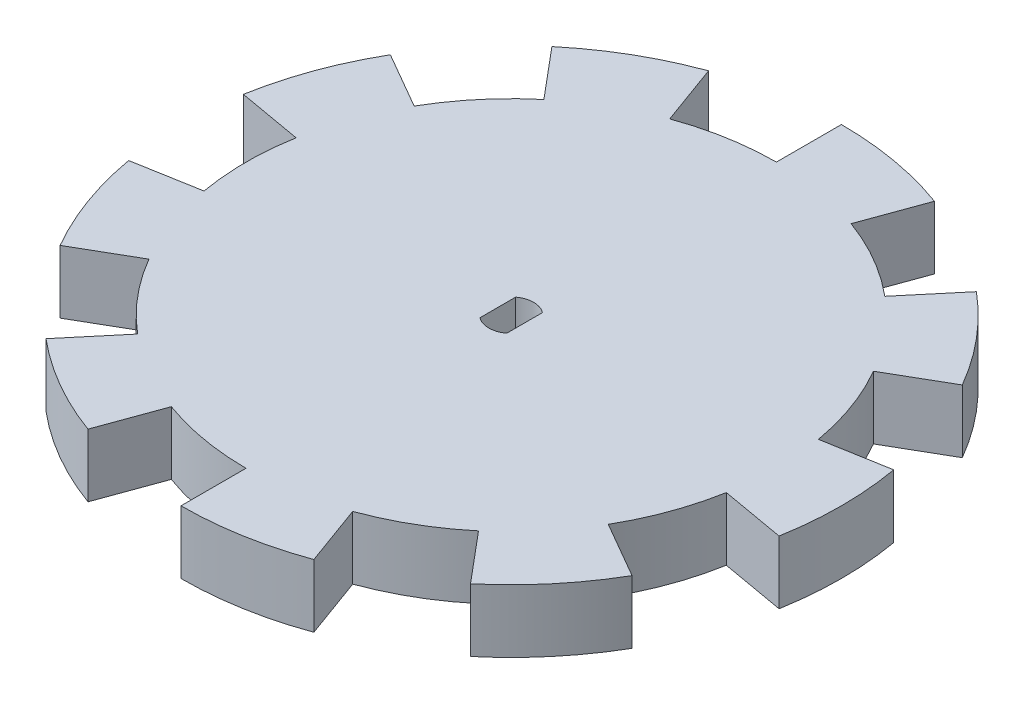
ISO-10303-21;
HEADER;
FILE_DESCRIPTION(('STEP AP214'),'2;1');
FILE_NAME('part.step','',(''),(''),'','','');
FILE_SCHEMA(('AUTOMOTIVE_DESIGN { 1 0 10303 214 1 1 1 1 }'));
ENDSEC;
DATA;
#1=APPLICATION_CONTEXT('core data for automotive mechanical design processes');
#2=APPLICATION_PROTOCOL_DEFINITION('international standard','automotive_design',2000,#1);
#3=PRODUCT_CONTEXT('',#1,'mechanical');
#4=PRODUCT('Part','Part','',(#3));
#5=PRODUCT_RELATED_PRODUCT_CATEGORY('part','',(#4));
#6=PRODUCT_DEFINITION_FORMATION('','',#4);
#7=PRODUCT_DEFINITION_CONTEXT('part definition',#1,'design');
#8=PRODUCT_DEFINITION('design','',#6,#7);
#9=PRODUCT_DEFINITION_SHAPE('','',#8);
#10=(LENGTH_UNIT() NAMED_UNIT(*) SI_UNIT(.MILLI.,.METRE.));
#11=(NAMED_UNIT(*) PLANE_ANGLE_UNIT() SI_UNIT($,.RADIAN.));
#12=(NAMED_UNIT(*) SI_UNIT($,.STERADIAN.) SOLID_ANGLE_UNIT());
#13=UNCERTAINTY_MEASURE_WITH_UNIT(LENGTH_MEASURE(1.E-05),#10,'distance_accuracy_value','');
#14=(GEOMETRIC_REPRESENTATION_CONTEXT(3) GLOBAL_UNCERTAINTY_ASSIGNED_CONTEXT((#13)) GLOBAL_UNIT_ASSIGNED_CONTEXT((#10,
#11,#12)) REPRESENTATION_CONTEXT('',''));
#15=CARTESIAN_POINT('',(0.,0.,0.));
#16=DIRECTION('',(0.,0.,1.));
#17=DIRECTION('',(1.,0.,0.));
#18=AXIS2_PLACEMENT_3D('',#15,#16,#17);
#19=CARTESIAN_POINT('',(0.,1.27,0.));
#20=DIRECTION('',(0.,-1.,0.));
#21=DIRECTION('',(0.,0.,-1.));
#22=AXIS2_PLACEMENT_3D('',#19,#20,#21);
#23=CYLINDRICAL_SURFACE('',#22,41.275);
#24=DIRECTION('',(0.,-1.,0.));
#25=VECTOR('',#24,1.);
#26=CARTESIAN_POINT('',(-35.7451985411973,29.8528857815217,-20.6375000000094));
#27=LINE('',#26,#25);
#28=CARTESIAN_POINT('',(-35.7451985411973,7.874,-20.6375000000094));
#29=VERTEX_POINT('',#28);
#30=CARTESIAN_POINT('',(-35.7451985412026,0.,-20.6375000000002));
#31=VERTEX_POINT('',#30);
#32=EDGE_CURVE('E407',#29,#31,#27,.T.);
#33=ORIENTED_EDGE('',*,*,#32,.T.);
#34=CARTESIAN_POINT('',(0.,0.,0.));
#35=DIRECTION('',(0.,1.,0.));
#36=DIRECTION('',(0.,0.,1.));
#37=AXIS2_PLACEMENT_3D('',#34,#35,#36);
#38=CIRCLE('',#37,41.275);
#39=CARTESIAN_POINT('',(-40.6479400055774,0.,-7.16732853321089));
#40=VERTEX_POINT('',#39);
#41=EDGE_CURVE('E402',#31,#40,#38,.T.);
#42=ORIENTED_EDGE('',*,*,#41,.T.);
#43=DIRECTION('',(0.,-1.,0.));
#44=VECTOR('',#43,1.);
#45=CARTESIAN_POINT('',(-40.6479400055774,29.8528857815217,-7.16732853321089));
#46=LINE('',#45,#44);
#47=CARTESIAN_POINT('',(-40.6479400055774,7.874,-7.16732853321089));
#48=VERTEX_POINT('',#47);
#49=EDGE_CURVE('E434',#48,#40,#46,.T.);
#50=ORIENTED_EDGE('',*,*,#49,.F.);
#51=CARTESIAN_POINT('',(0.,7.874,0.));
#52=DIRECTION('',(0.,1.,0.));
#53=DIRECTION('',(0.,0.,1.));
#54=AXIS2_PLACEMENT_3D('',#51,#52,#53);
#55=CIRCLE('',#54,41.275);
#56=EDGE_CURVE('E438',#48,#29,#55,.F.);
#57=ORIENTED_EDGE('',*,*,#56,.T.);
#58=EDGE_LOOP('',(#33,#42,#50,#57));
#59=FACE_BOUND('',#58,.T.);
#60=ADVANCED_FACE('F37',(#59),#23,.T.);
#61=CARTESIAN_POINT('',(-14.1168814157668,0.,-38.7858129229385));
#62=VERTEX_POINT('',#61);
#63=CARTESIAN_POINT('',(-26.5310585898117,0.,-31.618484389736));
#64=VERTEX_POINT('',#63);
#65=EDGE_CURVE('E637',#62,#64,#38,.T.);
#66=ORIENTED_EDGE('',*,*,#65,.T.);
#67=DIRECTION('',(0.,-1.,0.));
#68=VECTOR('',#67,1.);
#69=CARTESIAN_POINT('',(-26.5310585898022,29.8528857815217,-31.618484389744));
#70=LINE('',#69,#68);
#71=CARTESIAN_POINT('',(-26.5310585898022,7.874,-31.618484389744));
#72=VERTEX_POINT('',#71);
#73=EDGE_CURVE('E446',#72,#64,#70,.T.);
#74=ORIENTED_EDGE('',*,*,#73,.F.);
#75=CARTESIAN_POINT('',(0.,7.874,0.));
#76=DIRECTION('',(0.,1.,0.));
#77=DIRECTION('',(0.,0.,1.));
#78=AXIS2_PLACEMENT_3D('',#75,#76,#77);
#79=CIRCLE('',#78,41.275);
#80=CARTESIAN_POINT('',(-14.1168814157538,7.874,-38.7858129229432));
#81=VERTEX_POINT('',#80);
#82=EDGE_CURVE('E449',#72,#81,#79,.F.);
#83=ORIENTED_EDGE('',*,*,#82,.T.);
#84=DIRECTION('',(0.,-1.,0.));
#85=VECTOR('',#84,1.);
#86=CARTESIAN_POINT('',(-14.1168814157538,29.8528857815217,-38.7858129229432));
#87=LINE('',#86,#85);
#88=EDGE_CURVE('E452',#81,#62,#87,.T.);
#89=ORIENTED_EDGE('',*,*,#88,.T.);
#90=EDGE_LOOP('',(#66,#74,#83,#89));
#91=FACE_BOUND('',#90,.T.);
#92=ADVANCED_FACE('F781',(#91),#23,.T.);
#93=CARTESIAN_POINT('',(14.1168814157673,0.,-38.7858129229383));
#94=VERTEX_POINT('',#93);
#95=CARTESIAN_POINT('',(2.88221784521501E-13,0.,-41.275));
#96=VERTEX_POINT('',#95);
#97=EDGE_CURVE('E640',#94,#96,#38,.T.);
#98=ORIENTED_EDGE('',*,*,#97,.T.);
#99=DIRECTION('',(0.,-1.,0.));
#100=VECTOR('',#99,1.);
#101=CARTESIAN_POINT('',(1.4431689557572E-11,29.8528857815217,-41.275));
#102=LINE('',#101,#100);
#103=CARTESIAN_POINT('',(1.4431689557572E-11,7.874,-41.275));
#104=VERTEX_POINT('',#103);
#105=EDGE_CURVE('E458',#104,#96,#102,.T.);
#106=ORIENTED_EDGE('',*,*,#105,.F.);
#107=CARTESIAN_POINT('',(0.,7.874,0.));
#108=DIRECTION('',(0.,1.,0.));
#109=DIRECTION('',(0.,0.,1.));
#110=AXIS2_PLACEMENT_3D('',#107,#108,#109);
#111=CIRCLE('',#110,41.275);
#112=CARTESIAN_POINT('',(14.1168814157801,7.874,-38.7858129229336));
#113=VERTEX_POINT('',#112);
#114=EDGE_CURVE('E460',#104,#113,#111,.F.);
#115=ORIENTED_EDGE('',*,*,#114,.T.);
#116=DIRECTION('',(0.,-1.,0.));
#117=VECTOR('',#116,1.);
#118=CARTESIAN_POINT('',(14.1168814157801,29.8528857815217,-38.7858129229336));
#119=LINE('',#118,#117);
#120=EDGE_CURVE('E463',#113,#94,#119,.T.);
#121=ORIENTED_EDGE('',*,*,#120,.T.);
#122=EDGE_LOOP('',(#98,#106,#115,#121));
#123=FACE_BOUND('',#122,.T.);
#124=ADVANCED_FACE('F786',(#123),#23,.T.);
#125=CARTESIAN_POINT('',(35.7451985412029,0.,-20.6374999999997));
#126=VERTEX_POINT('',#125);
#127=CARTESIAN_POINT('',(26.5310585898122,0.,-31.6184843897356));
#128=VERTEX_POINT('',#127);
#129=EDGE_CURVE('E642',#126,#128,#38,.T.);
#130=ORIENTED_EDGE('',*,*,#129,.T.);
#131=DIRECTION('',(0.,-1.,0.));
#132=VECTOR('',#131,1.);
#133=CARTESIAN_POINT('',(26.5310585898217,29.8528857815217,-31.6184843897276));
#134=LINE('',#133,#132);
#135=CARTESIAN_POINT('',(26.5310585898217,7.874,-31.6184843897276));
#136=VERTEX_POINT('',#135);
#137=EDGE_CURVE('E469',#136,#128,#134,.T.);
#138=ORIENTED_EDGE('',*,*,#137,.F.);
#139=CARTESIAN_POINT('',(0.,7.874,0.));
#140=DIRECTION('',(0.,1.,0.));
#141=DIRECTION('',(0.,0.,1.));
#142=AXIS2_PLACEMENT_3D('',#139,#140,#141);
#143=CIRCLE('',#142,41.275);
#144=CARTESIAN_POINT('',(35.7451985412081,7.874,-20.6374999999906));
#145=VERTEX_POINT('',#144);
#146=EDGE_CURVE('E471',#136,#145,#143,.F.);
#147=ORIENTED_EDGE('',*,*,#146,.T.);
#148=DIRECTION('',(0.,-1.,0.));
#149=VECTOR('',#148,1.);
#150=CARTESIAN_POINT('',(35.7451985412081,29.8528857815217,-20.6374999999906));
#151=LINE('',#150,#149);
#152=EDGE_CURVE('E474',#145,#126,#151,.T.);
#153=ORIENTED_EDGE('',*,*,#152,.T.);
#154=EDGE_LOOP('',(#130,#138,#147,#153));
#155=FACE_BOUND('',#154,.T.);
#156=ADVANCED_FACE('F701',(#155),#23,.T.);
#157=CARTESIAN_POINT('',(40.6479400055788,0.,7.16732853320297));
#158=VERTEX_POINT('',#157);
#159=CARTESIAN_POINT('',(40.647940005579,0.,-7.16732853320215));
#160=VERTEX_POINT('',#159);
#161=EDGE_CURVE('E689',#158,#160,#38,.T.);
#162=ORIENTED_EDGE('',*,*,#161,.T.);
#163=DIRECTION('',(0.,-1.,0.));
#164=VECTOR('',#163,1.);
#165=CARTESIAN_POINT('',(40.6479400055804,29.8528857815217,-7.16732853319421));
#166=LINE('',#165,#164);
#167=CARTESIAN_POINT('',(40.6479400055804,7.874,-7.16732853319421));
#168=VERTEX_POINT('',#167);
#169=EDGE_CURVE('E480',#168,#160,#166,.T.);
#170=ORIENTED_EDGE('',*,*,#169,.F.);
#171=CARTESIAN_POINT('',(0.,7.874,0.));
#172=DIRECTION('',(0.,1.,0.));
#173=DIRECTION('',(0.,0.,1.));
#174=AXIS2_PLACEMENT_3D('',#171,#172,#173);
#175=CIRCLE('',#174,41.275);
#176=CARTESIAN_POINT('',(40.6479400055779,7.874,7.16732853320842));
#177=VERTEX_POINT('',#176);
#178=EDGE_CURVE('E482',#168,#177,#175,.F.);
#179=ORIENTED_EDGE('',*,*,#178,.T.);
#180=DIRECTION('',(0.,-1.,0.));
#181=VECTOR('',#180,1.);
#182=CARTESIAN_POINT('',(40.6479400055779,29.8528857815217,7.16732853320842));
#183=LINE('',#182,#181);
#184=EDGE_CURVE('E485',#177,#158,#183,.T.);
#185=ORIENTED_EDGE('',*,*,#184,.T.);
#186=EDGE_LOOP('',(#162,#170,#179,#185));
#187=FACE_BOUND('',#186,.T.);
#188=ADVANCED_FACE('F728',(#187),#23,.T.);
#189=CARTESIAN_POINT('',(26.5310585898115,0.,31.6184843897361));
#190=VERTEX_POINT('',#189);
#191=CARTESIAN_POINT('',(35.7451985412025,0.,20.6375000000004));
#192=VERTEX_POINT('',#191);
#193=EDGE_CURVE('E684',#190,#192,#38,.T.);
#194=ORIENTED_EDGE('',*,*,#193,.T.);
#195=DIRECTION('',(0.,-1.,0.));
#196=VECTOR('',#195,1.);
#197=CARTESIAN_POINT('',(35.7451985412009,29.8528857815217,20.6375000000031));
#198=LINE('',#197,#196);
#199=CARTESIAN_POINT('',(35.7451985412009,7.874,20.6375000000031));
#200=VERTEX_POINT('',#199);
#201=EDGE_CURVE('E491',#200,#192,#198,.T.);
#202=ORIENTED_EDGE('',*,*,#201,.F.);
#203=CARTESIAN_POINT('',(0.,7.874,0.));
#204=DIRECTION('',(0.,1.,0.));
#205=DIRECTION('',(0.,0.,1.));
#206=AXIS2_PLACEMENT_3D('',#203,#204,#205);
#207=CIRCLE('',#206,41.275);
#208=CARTESIAN_POINT('',(26.5310585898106,7.874,31.6184843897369));
#209=VERTEX_POINT('',#208);
#210=EDGE_CURVE('E493',#200,#209,#207,.F.);
#211=ORIENTED_EDGE('',*,*,#210,.T.);
#212=DIRECTION('',(0.,-1.,0.));
#213=VECTOR('',#212,1.);
#214=CARTESIAN_POINT('',(26.5310585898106,29.8528857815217,31.6184843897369));
#215=LINE('',#214,#213);
#216=EDGE_CURVE('E496',#209,#190,#215,.T.);
#217=ORIENTED_EDGE('',*,*,#216,.T.);
#218=EDGE_LOOP('',(#194,#202,#211,#217));
#219=FACE_BOUND('',#218,.T.);
#220=ADVANCED_FACE('F743',(#219),#23,.T.);
#221=CARTESIAN_POINT('',(0.,0.,41.275));
#222=VERTEX_POINT('',#221);
#223=CARTESIAN_POINT('',(14.1168814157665,0.,38.7858129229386));
#224=VERTEX_POINT('',#223);
#225=EDGE_CURVE('E682',#222,#224,#38,.T.);
#226=ORIENTED_EDGE('',*,*,#225,.T.);
#227=DIRECTION('',(0.,-1.,0.));
#228=VECTOR('',#227,1.);
#229=CARTESIAN_POINT('',(14.1168814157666,29.8528857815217,38.7858129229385));
#230=LINE('',#229,#228);
#231=CARTESIAN_POINT('',(14.1168814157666,7.874,38.7858129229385));
#232=VERTEX_POINT('',#231);
#233=EDGE_CURVE('E502',#232,#224,#230,.T.);
#234=ORIENTED_EDGE('',*,*,#233,.F.);
#235=CARTESIAN_POINT('',(0.,7.874,0.));
#236=DIRECTION('',(0.,1.,0.));
#237=DIRECTION('',(0.,0.,1.));
#238=AXIS2_PLACEMENT_3D('',#235,#236,#237);
#239=CIRCLE('',#238,41.275);
#240=CARTESIAN_POINT('',(0.,7.874,41.275));
#241=VERTEX_POINT('',#240);
#242=EDGE_CURVE('E504',#232,#241,#239,.F.);
#243=ORIENTED_EDGE('',*,*,#242,.T.);
#244=DIRECTION('',(0.,-1.,0.));
#245=VECTOR('',#244,1.);
#246=CARTESIAN_POINT('',(0.,29.8528857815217,41.275));
#247=LINE('',#246,#245);
#248=EDGE_CURVE('E507',#241,#222,#247,.T.);
#249=ORIENTED_EDGE('',*,*,#248,.T.);
#250=EDGE_LOOP('',(#226,#234,#243,#249));
#251=FACE_BOUND('',#250,.T.);
#252=ADVANCED_FACE('F758',(#251),#23,.T.);
#253=CARTESIAN_POINT('',(-26.531058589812,0.,31.6184843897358));
#254=VERTEX_POINT('',#253);
#255=CARTESIAN_POINT('',(-14.116881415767,0.,38.7858129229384));
#256=VERTEX_POINT('',#255);
#257=EDGE_CURVE('E543',#254,#256,#38,.T.);
#258=ORIENTED_EDGE('',*,*,#257,.T.);
#259=DIRECTION('',(0.,-1.,0.));
#260=VECTOR('',#259,1.);
#261=CARTESIAN_POINT('',(-14.1168814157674,29.8528857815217,38.7858129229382));
#262=LINE('',#261,#260);
#263=CARTESIAN_POINT('',(-14.1168814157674,7.874,38.7858129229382));
#264=VERTEX_POINT('',#263);
#265=EDGE_CURVE('E663',#264,#256,#262,.T.);
#266=ORIENTED_EDGE('',*,*,#265,.F.);
#267=CARTESIAN_POINT('',(0.,7.874,0.));
#268=DIRECTION('',(0.,1.,0.));
#269=DIRECTION('',(0.,0.,1.));
#270=AXIS2_PLACEMENT_3D('',#267,#268,#269);
#271=CIRCLE('',#270,41.275);
#272=CARTESIAN_POINT('',(-26.5310585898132,7.874,31.6184843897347));
#273=VERTEX_POINT('',#272);
#274=EDGE_CURVE('E665',#264,#273,#271,.F.);
#275=ORIENTED_EDGE('',*,*,#274,.T.);
#276=DIRECTION('',(0.,-1.,0.));
#277=VECTOR('',#276,1.);
#278=CARTESIAN_POINT('',(-26.5310585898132,29.8528857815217,31.6184843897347));
#279=LINE('',#278,#277);
#280=EDGE_CURVE('E661',#273,#254,#279,.T.);
#281=ORIENTED_EDGE('',*,*,#280,.T.);
#282=EDGE_LOOP('',(#258,#266,#275,#281));
#283=FACE_BOUND('',#282,.T.);
#284=ADVANCED_FACE('F681',(#283),#23,.T.);
#285=CARTESIAN_POINT('',(0.,0.,0.));
#286=DIRECTION('',(0.,1.,0.));
#287=DIRECTION('',(0.,0.,1.));
#288=AXIS2_PLACEMENT_3D('',#285,#286,#287);
#289=PLANE('',#288);
#290=CARTESIAN_POINT('',(0.,0.,0.));
#291=DIRECTION('',(0.,-1.,0.));
#292=DIRECTION('',(0.,0.,-1.));
#293=AXIS2_PLACEMENT_3D('',#290,#291,#292);
#294=CIRCLE('',#293,28.575);
#295=CARTESIAN_POINT('',(0.,0.,-28.575));
#296=VERTEX_POINT('',#295);
#297=EDGE_CURVE('E514',#296,#296,#294,.T.);
#298=ORIENTED_EDGE('',*,*,#297,.F.);
#299=EDGE_LOOP('',(#298));
#300=FACE_BOUND('',#299,.T.);
#301=DIRECTION('',(-0.866025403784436,0.,-0.500000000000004));
#302=VECTOR('',#301,1.);
#303=CARTESIAN_POINT('',(0.,0.,0.));
#304=LINE('',#303,#302);
#305=CARTESIAN_POINT('',(-28.7061440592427,0.,-16.5735000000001));
#306=VERTEX_POINT('',#305);
#307=EDGE_CURVE('E11',#306,#31,#304,.T.);
#308=ORIENTED_EDGE('',*,*,#307,.F.);
#309=CARTESIAN_POINT('',(0.,0.,0.));
#310=DIRECTION('',(0.,1.,0.));
#311=DIRECTION('',(0.,0.,1.));
#312=AXIS2_PLACEMENT_3D('',#309,#310,#311);
#313=CIRCLE('',#312,33.147);
#314=CARTESIAN_POINT('',(-21.3064808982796,0.,-25.3920751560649));
#315=VERTEX_POINT('',#314);
#316=EDGE_CURVE('E46',#315,#306,#313,.T.);
#317=ORIENTED_EDGE('',*,*,#316,.F.);
#318=DIRECTION('',(-0.642787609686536,0.,-0.766044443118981));
#319=VECTOR('',#318,1.);
#320=CARTESIAN_POINT('',(0.,0.,0.));
#321=LINE('',#320,#319);
#322=EDGE_CURVE('E389',#315,#64,#321,.T.);
#323=ORIENTED_EDGE('',*,*,#322,.T.);
#324=ORIENTED_EDGE('',*,*,#65,.F.);
#325=DIRECTION('',(-0.342020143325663,0.,-0.939692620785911));
#326=VECTOR('',#325,1.);
#327=CARTESIAN_POINT('',(0.,0.,0.));
#328=LINE('',#327,#326);
#329=CARTESIAN_POINT('',(-11.3369416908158,0.,-31.1479913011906));
#330=VERTEX_POINT('',#329);
#331=EDGE_CURVE('E386',#330,#62,#328,.T.);
#332=ORIENTED_EDGE('',*,*,#331,.F.);
#333=CARTESIAN_POINT('',(0.,0.,0.));
#334=DIRECTION('',(0.,1.,0.));
#335=DIRECTION('',(0.,0.,1.));
#336=AXIS2_PLACEMENT_3D('',#333,#334,#335);
#337=CIRCLE('',#336,33.147);
#338=CARTESIAN_POINT('',(2.31464263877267E-13,0.,-33.147));
#339=VERTEX_POINT('',#338);
#340=EDGE_CURVE('E383',#339,#330,#337,.T.);
#341=ORIENTED_EDGE('',*,*,#340,.F.);
#342=DIRECTION('',(0.,0.,-1.));
#343=VECTOR('',#342,1.);
#344=CARTESIAN_POINT('',(0.,0.,0.));
#345=LINE('',#344,#343);
#346=EDGE_CURVE('E380',#339,#96,#345,.T.);
#347=ORIENTED_EDGE('',*,*,#346,.T.);
#348=ORIENTED_EDGE('',*,*,#97,.F.);
#349=DIRECTION('',(0.342020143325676,0.,-0.939692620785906));
#350=VECTOR('',#349,1.);
#351=CARTESIAN_POINT('',(0.,0.,0.));
#352=LINE('',#351,#350);
#353=CARTESIAN_POINT('',(11.3369416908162,0.,-31.1479913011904));
#354=VERTEX_POINT('',#353);
#355=EDGE_CURVE('E377',#354,#94,#352,.T.);
#356=ORIENTED_EDGE('',*,*,#355,.F.);
#357=CARTESIAN_POINT('',(0.,0.,0.));
#358=DIRECTION('',(0.,1.,0.));
#359=DIRECTION('',(0.,0.,1.));
#360=AXIS2_PLACEMENT_3D('',#357,#358,#359);
#361=CIRCLE('',#360,33.147);
#362=CARTESIAN_POINT('',(21.3064808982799,0.,-25.3920751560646));
#363=VERTEX_POINT('',#362);
#364=EDGE_CURVE('E374',#363,#354,#361,.T.);
#365=ORIENTED_EDGE('',*,*,#364,.F.);
#366=DIRECTION('',(0.642787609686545,0.,-0.766044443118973));
#367=VECTOR('',#366,1.);
#368=CARTESIAN_POINT('',(0.,0.,0.));
#369=LINE('',#368,#367);
#370=EDGE_CURVE('E371',#363,#128,#369,.T.);
#371=ORIENTED_EDGE('',*,*,#370,.T.);
#372=ORIENTED_EDGE('',*,*,#129,.F.);
#373=DIRECTION('',(0.866025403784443,0.,-0.499999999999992));
#374=VECTOR('',#373,1.);
#375=CARTESIAN_POINT('',(0.,0.,0.));
#376=LINE('',#375,#374);
#377=CARTESIAN_POINT('',(28.7061440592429,0.,-16.5734999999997));
#378=VERTEX_POINT('',#377);
#379=EDGE_CURVE('E368',#378,#126,#376,.T.);
#380=ORIENTED_EDGE('',*,*,#379,.F.);
#381=CARTESIAN_POINT('',(0.,0.,0.));
#382=DIRECTION('',(0.,1.,0.));
#383=DIRECTION('',(0.,0.,1.));
#384=AXIS2_PLACEMENT_3D('',#381,#382,#383);
#385=CIRCLE('',#384,33.147);
#386=CARTESIAN_POINT('',(32.6434225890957,0.,-5.75591614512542));
#387=VERTEX_POINT('',#386);
#388=EDGE_CURVE('E365',#387,#378,#385,.T.);
#389=ORIENTED_EDGE('',*,*,#388,.F.);
#390=DIRECTION('',(0.98480775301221,0.,-0.173648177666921));
#391=VECTOR('',#390,1.);
#392=CARTESIAN_POINT('',(0.,0.,0.));
#393=LINE('',#392,#391);
#394=EDGE_CURVE('E362',#387,#160,#393,.T.);
#395=ORIENTED_EDGE('',*,*,#394,.T.);
#396=ORIENTED_EDGE('',*,*,#161,.F.);
#397=DIRECTION('',(0.984807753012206,0.,0.173648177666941));
#398=VECTOR('',#397,1.);
#399=CARTESIAN_POINT('',(0.,0.,0.));
#400=LINE('',#399,#398);
#401=CARTESIAN_POINT('',(32.6434225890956,0.,5.75591614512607));
#402=VERTEX_POINT('',#401);
#403=EDGE_CURVE('E359',#402,#158,#400,.T.);
#404=ORIENTED_EDGE('',*,*,#403,.F.);
#405=CARTESIAN_POINT('',(0.,0.,0.));
#406=DIRECTION('',(0.,1.,0.));
#407=DIRECTION('',(0.,0.,1.));
#408=AXIS2_PLACEMENT_3D('',#405,#406,#407);
#409=CIRCLE('',#408,33.147);
#410=CARTESIAN_POINT('',(28.7061440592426,0.,16.5735000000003));
#411=VERTEX_POINT('',#410);
#412=EDGE_CURVE('E356',#411,#402,#409,.T.);
#413=ORIENTED_EDGE('',*,*,#412,.F.);
#414=DIRECTION('',(0.866025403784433,0.,0.50000000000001));
#415=VECTOR('',#414,1.);
#416=CARTESIAN_POINT('',(0.,0.,0.));
#417=LINE('',#416,#415);
#418=EDGE_CURVE('E353',#411,#192,#417,.T.);
#419=ORIENTED_EDGE('',*,*,#418,.T.);
#420=ORIENTED_EDGE('',*,*,#193,.F.);
#421=DIRECTION('',(0.64278760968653,0.,0.766044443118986));
#422=VECTOR('',#421,1.);
#423=CARTESIAN_POINT('',(0.,0.,0.));
#424=LINE('',#423,#422);
#425=CARTESIAN_POINT('',(21.3064808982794,0.,25.392075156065));
#426=VERTEX_POINT('',#425);
#427=EDGE_CURVE('E350',#426,#190,#424,.T.);
#428=ORIENTED_EDGE('',*,*,#427,.F.);
#429=CARTESIAN_POINT('',(0.,0.,0.));
#430=DIRECTION('',(0.,1.,0.));
#431=DIRECTION('',(0.,0.,1.));
#432=AXIS2_PLACEMENT_3D('',#429,#430,#431);
#433=CIRCLE('',#432,33.147);
#434=CARTESIAN_POINT('',(11.3369416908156,0.,31.1479913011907));
#435=VERTEX_POINT('',#434);
#436=EDGE_CURVE('E347',#435,#426,#433,.T.);
#437=ORIENTED_EDGE('',*,*,#436,.F.);
#438=DIRECTION('',(0.342020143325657,0.,0.939692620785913));
#439=VECTOR('',#438,1.);
#440=CARTESIAN_POINT('',(0.,0.,0.));
#441=LINE('',#440,#439);
#442=EDGE_CURVE('E344',#435,#224,#441,.T.);
#443=ORIENTED_EDGE('',*,*,#442,.T.);
#444=ORIENTED_EDGE('',*,*,#225,.F.);
#445=DIRECTION('',(0.,0.,1.));
#446=VECTOR('',#445,1.);
#447=CARTESIAN_POINT('',(0.,0.,0.));
#448=LINE('',#447,#446);
#449=CARTESIAN_POINT('',(0.,0.,33.147));
#450=VERTEX_POINT('',#449);
#451=EDGE_CURVE('E341',#450,#222,#448,.T.);
#452=ORIENTED_EDGE('',*,*,#451,.F.);
#453=CARTESIAN_POINT('',(0.,0.,0.));
#454=DIRECTION('',(0.,1.,0.));
#455=DIRECTION('',(0.,0.,1.));
#456=AXIS2_PLACEMENT_3D('',#453,#454,#455);
#457=CIRCLE('',#456,33.147);
#458=CARTESIAN_POINT('',(-11.336941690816,0.,31.1479913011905));
#459=VERTEX_POINT('',#458);
#460=EDGE_CURVE('E338',#459,#450,#457,.T.);
#461=ORIENTED_EDGE('',*,*,#460,.F.);
#462=DIRECTION('',(-0.34202014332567,0.,0.939692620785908));
#463=VECTOR('',#462,1.);
#464=CARTESIAN_POINT('',(0.,0.,0.));
#465=LINE('',#464,#463);
#466=EDGE_CURVE('E332',#459,#256,#465,.T.);
#467=ORIENTED_EDGE('',*,*,#466,.T.);
#468=ORIENTED_EDGE('',*,*,#257,.F.);
#469=DIRECTION('',(-0.64278760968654,0.,0.766044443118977));
#470=VECTOR('',#469,1.);
#471=CARTESIAN_POINT('',(0.,0.,0.));
#472=LINE('',#471,#470);
#473=CARTESIAN_POINT('',(-21.3064808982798,0.,25.3920751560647));
#474=VERTEX_POINT('',#473);
#475=EDGE_CURVE('E330',#474,#254,#472,.T.);
#476=ORIENTED_EDGE('',*,*,#475,.F.);
#477=CARTESIAN_POINT('',(0.,0.,0.));
#478=DIRECTION('',(0.,1.,0.));
#479=DIRECTION('',(0.,0.,1.));
#480=AXIS2_PLACEMENT_3D('',#477,#478,#479);
#481=CIRCLE('',#480,33.147);
#482=CARTESIAN_POINT('',(-28.7061440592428,0.,16.5734999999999));
#483=VERTEX_POINT('',#482);
#484=EDGE_CURVE('E309',#483,#474,#481,.T.);
#485=ORIENTED_EDGE('',*,*,#484,.F.);
#486=DIRECTION('',(-0.86602540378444,0.,0.499999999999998));
#487=VECTOR('',#486,1.);
#488=CARTESIAN_POINT('',(0.,0.,0.));
#489=LINE('',#488,#487);
#490=CARTESIAN_POINT('',(-35.7451985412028,0.,20.6374999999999));
#491=VERTEX_POINT('',#490);
#492=EDGE_CURVE('E317',#483,#491,#489,.T.);
#493=ORIENTED_EDGE('',*,*,#492,.T.);
#494=CARTESIAN_POINT('',(-40.6479400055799,0.,7.16732853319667));
#495=VERTEX_POINT('',#494);
#496=EDGE_CURVE('E540',#495,#491,#38,.T.);
#497=ORIENTED_EDGE('',*,*,#496,.F.);
#498=DIRECTION('',(0.984807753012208,0.,-0.17364817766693));
#499=VECTOR('',#498,1.);
#500=CARTESIAN_POINT('',(-1.03593537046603E-12,0.,-5.87508143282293E-12));
#501=LINE('',#500,#499);
#502=CARTESIAN_POINT('',(-32.6434225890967,0.,5.75591614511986));
#503=VERTEX_POINT('',#502);
#504=EDGE_CURVE('E421',#495,#503,#501,.T.);
#505=ORIENTED_EDGE('',*,*,#504,.T.);
#506=CARTESIAN_POINT('',(0.,0.,0.));
#507=DIRECTION('',(0.,1.,0.));
#508=DIRECTION('',(0.,0.,1.));
#509=AXIS2_PLACEMENT_3D('',#506,#507,#508);
#510=CIRCLE('',#509,33.147);
#511=CARTESIAN_POINT('',(-32.6434225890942,0.,-5.75591614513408));
#512=VERTEX_POINT('',#511);
#513=EDGE_CURVE('E424',#503,#512,#510,.F.);
#514=ORIENTED_EDGE('',*,*,#513,.T.);
#515=DIRECTION('',(-0.984807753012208,0.,-0.17364817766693));
#516=VECTOR('',#515,1.);
#517=CARTESIAN_POINT('',(1.47031129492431E-12,0.,-8.3385497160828E-12));
#518=LINE('',#517,#516);
#519=EDGE_CURVE('E324',#512,#40,#518,.T.);
#520=ORIENTED_EDGE('',*,*,#519,.T.);
#521=ORIENTED_EDGE('',*,*,#41,.F.);
#522=EDGE_LOOP('',(#308,#317,#323,#324,#332,#341,#347,#348,#356,#365,#371,#372,#380,#389,#395,
#396,#404,#413,#419,#420,#428,#437,#443,#444,#452,#461,#467,#468,#476,#485,#493,#497,#505,#514,
#520,#521));
#523=FACE_BOUND('',#522,.T.);
#524=ADVANCED_FACE('F327',(#300,#523),#289,.F.);
#525=CARTESIAN_POINT('',(0.,7.874,0.));
#526=DIRECTION('',(0.,-1.,0.));
#527=DIRECTION('',(0.,0.,-1.));
#528=AXIS2_PLACEMENT_3D('',#525,#526,#527);
#529=CYLINDRICAL_SURFACE('',#528,33.147);
#530=DIRECTION('',(0.,-1.,0.));
#531=VECTOR('',#530,1.);
#532=CARTESIAN_POINT('',(-21.306480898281,7.874,25.3920751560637));
#533=LINE('',#532,#531);
#534=CARTESIAN_POINT('',(-21.306480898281,7.874,25.3920751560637));
#535=VERTEX_POINT('',#534);
#536=EDGE_CURVE('E61',#535,#474,#533,.T.);
#537=ORIENTED_EDGE('',*,*,#536,.F.);
#538=CARTESIAN_POINT('',(0.,7.874,0.));
#539=DIRECTION('',(0.,1.,0.));
#540=DIRECTION('',(0.,0.,1.));
#541=AXIS2_PLACEMENT_3D('',#538,#539,#540);
#542=CIRCLE('',#541,33.147);
#543=CARTESIAN_POINT('',(-28.7061440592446,7.874,16.5734999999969));
#544=VERTEX_POINT('',#543);
#545=EDGE_CURVE('E311',#544,#535,#542,.T.);
#546=ORIENTED_EDGE('',*,*,#545,.F.);
#547=DIRECTION('',(0.,-1.,0.));
#548=VECTOR('',#547,1.);
#549=CARTESIAN_POINT('',(-28.7061440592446,7.874,16.5734999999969));
#550=LINE('',#549,#548);
#551=EDGE_CURVE('E305',#544,#483,#550,.T.);
#552=ORIENTED_EDGE('',*,*,#551,.T.);
#553=ORIENTED_EDGE('',*,*,#484,.T.);
#554=EDGE_LOOP('',(#537,#546,#552,#553));
#555=FACE_BOUND('',#554,.T.);
#556=ADVANCED_FACE('F307',(#555),#529,.T.);
#557=DIRECTION('',(0.,-1.,0.));
#558=VECTOR('',#557,1.);
#559=CARTESIAN_POINT('',(-32.6434225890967,7.874,5.75591614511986));
#560=LINE('',#559,#558);
#561=CARTESIAN_POINT('',(-32.6434225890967,7.874,5.75591614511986));
#562=VERTEX_POINT('',#561);
#563=EDGE_CURVE('E314',#562,#503,#560,.T.);
#564=ORIENTED_EDGE('',*,*,#563,.F.);
#565=CARTESIAN_POINT('',(-32.6434225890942,7.874,-5.75591614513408));
#566=VERTEX_POINT('',#565);
#567=EDGE_CURVE('E831',#566,#562,#542,.T.);
#568=ORIENTED_EDGE('',*,*,#567,.F.);
#569=DIRECTION('',(0.,-1.,0.));
#570=VECTOR('',#569,1.);
#571=CARTESIAN_POINT('',(-32.6434225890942,7.874,-5.75591614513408));
#572=LINE('',#571,#570);
#573=EDGE_CURVE('E410',#566,#512,#572,.T.);
#574=ORIENTED_EDGE('',*,*,#573,.T.);
#575=ORIENTED_EDGE('',*,*,#513,.F.);
#576=EDGE_LOOP('',(#564,#568,#574,#575));
#577=FACE_BOUND('',#576,.T.);
#578=ADVANCED_FACE('F777',(#577),#529,.T.);
#579=DIRECTION('',(0.,-1.,0.));
#580=VECTOR('',#579,1.);
#581=CARTESIAN_POINT('',(-28.7061440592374,7.874,-16.5735000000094));
#582=LINE('',#581,#580);
#583=CARTESIAN_POINT('',(-28.7061440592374,7.874,-16.5735000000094));
#584=VERTEX_POINT('',#583);
#585=EDGE_CURVE('E395',#584,#306,#582,.T.);
#586=ORIENTED_EDGE('',*,*,#585,.F.);
#587=CARTESIAN_POINT('',(-21.30648089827,7.874,-25.392075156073));
#588=VERTEX_POINT('',#587);
#589=EDGE_CURVE('E649',#588,#584,#542,.T.);
#590=ORIENTED_EDGE('',*,*,#589,.F.);
#591=DIRECTION('',(0.,-1.,0.));
#592=VECTOR('',#591,1.);
#593=CARTESIAN_POINT('',(-21.30648089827,7.874,-25.392075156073));
#594=LINE('',#593,#592);
#595=EDGE_CURVE('E398',#588,#315,#594,.T.);
#596=ORIENTED_EDGE('',*,*,#595,.T.);
#597=ORIENTED_EDGE('',*,*,#316,.T.);
#598=EDGE_LOOP('',(#586,#590,#596,#597));
#599=FACE_BOUND('',#598,.T.);
#600=ADVANCED_FACE('F394',(#599),#529,.T.);
#601=DIRECTION('',(0.,-1.,0.));
#602=VECTOR('',#601,1.);
#603=CARTESIAN_POINT('',(-11.3369416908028,7.874,-31.1479913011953));
#604=LINE('',#603,#602);
#605=CARTESIAN_POINT('',(-11.3369416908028,7.874,-31.1479913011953));
#606=VERTEX_POINT('',#605);
#607=EDGE_CURVE('E413',#606,#330,#604,.T.);
#608=ORIENTED_EDGE('',*,*,#607,.F.);
#609=CARTESIAN_POINT('',(1.44306941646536E-11,7.874,-33.147));
#610=VERTEX_POINT('',#609);
#611=EDGE_CURVE('E830',#610,#606,#542,.T.);
#612=ORIENTED_EDGE('',*,*,#611,.F.);
#613=DIRECTION('',(0.,-1.,0.));
#614=VECTOR('',#613,1.);
#615=CARTESIAN_POINT('',(1.44306941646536E-11,7.874,-33.147));
#616=LINE('',#615,#614);
#617=EDGE_CURVE('E623',#610,#339,#616,.T.);
#618=ORIENTED_EDGE('',*,*,#617,.T.);
#619=ORIENTED_EDGE('',*,*,#340,.T.);
#620=EDGE_LOOP('',(#608,#612,#618,#619));
#621=FACE_BOUND('',#620,.T.);
#622=ADVANCED_FACE('F633',(#621),#529,.T.);
#623=DIRECTION('',(0.,-1.,0.));
#624=VECTOR('',#623,1.);
#625=CARTESIAN_POINT('',(11.3369416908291,7.874,-31.1479913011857));
#626=LINE('',#625,#624);
#627=CARTESIAN_POINT('',(11.3369416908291,7.874,-31.1479913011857));
#628=VERTEX_POINT('',#627);
#629=EDGE_CURVE('E621',#628,#354,#626,.T.);
#630=ORIENTED_EDGE('',*,*,#629,.F.);
#631=CARTESIAN_POINT('',(21.3064808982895,7.874,-25.3920751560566));
#632=VERTEX_POINT('',#631);
#633=EDGE_CURVE('E825',#632,#628,#542,.T.);
#634=ORIENTED_EDGE('',*,*,#633,.F.);
#635=DIRECTION('',(0.,-1.,0.));
#636=VECTOR('',#635,1.);
#637=CARTESIAN_POINT('',(21.3064808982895,7.874,-25.3920751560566));
#638=LINE('',#637,#636);
#639=EDGE_CURVE('E619',#632,#363,#638,.T.);
#640=ORIENTED_EDGE('',*,*,#639,.T.);
#641=ORIENTED_EDGE('',*,*,#364,.T.);
#642=EDGE_LOOP('',(#630,#634,#640,#641));
#643=FACE_BOUND('',#642,.T.);
#644=ADVANCED_FACE('F829',(#643),#529,.T.);
#645=DIRECTION('',(0.,-1.,0.));
#646=VECTOR('',#645,1.);
#647=CARTESIAN_POINT('',(28.7061440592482,7.874,-16.5734999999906));
#648=LINE('',#647,#646);
#649=CARTESIAN_POINT('',(28.7061440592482,7.874,-16.5734999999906));
#650=VERTEX_POINT('',#649);
#651=EDGE_CURVE('E617',#650,#378,#648,.T.);
#652=ORIENTED_EDGE('',*,*,#651,.F.);
#653=CARTESIAN_POINT('',(32.6434225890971,7.874,-5.7559161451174));
#654=VERTEX_POINT('',#653);
#655=EDGE_CURVE('E717',#654,#650,#542,.T.);
#656=ORIENTED_EDGE('',*,*,#655,.F.);
#657=DIRECTION('',(0.,-1.,0.));
#658=VECTOR('',#657,1.);
#659=CARTESIAN_POINT('',(32.6434225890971,7.874,-5.7559161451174));
#660=LINE('',#659,#658);
#661=EDGE_CURVE('E615',#654,#387,#660,.T.);
#662=ORIENTED_EDGE('',*,*,#661,.T.);
#663=ORIENTED_EDGE('',*,*,#388,.T.);
#664=EDGE_LOOP('',(#652,#656,#662,#663));
#665=FACE_BOUND('',#664,.T.);
#666=ADVANCED_FACE('F721',(#665),#529,.T.);
#667=DIRECTION('',(0.,-1.,0.));
#668=VECTOR('',#667,1.);
#669=CARTESIAN_POINT('',(32.6434225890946,7.874,5.75591614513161));
#670=LINE('',#669,#668);
#671=CARTESIAN_POINT('',(32.6434225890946,7.874,5.75591614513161));
#672=VERTEX_POINT('',#671);
#673=EDGE_CURVE('E613',#672,#402,#670,.T.);
#674=ORIENTED_EDGE('',*,*,#673,.F.);
#675=CARTESIAN_POINT('',(28.706144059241,7.874,16.5735000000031));
#676=VERTEX_POINT('',#675);
#677=EDGE_CURVE('E539',#676,#672,#542,.T.);
#678=ORIENTED_EDGE('',*,*,#677,.F.);
#679=DIRECTION('',(0.,-1.,0.));
#680=VECTOR('',#679,1.);
#681=CARTESIAN_POINT('',(28.706144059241,7.874,16.5735000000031));
#682=LINE('',#681,#680);
#683=EDGE_CURVE('E611',#676,#411,#682,.T.);
#684=ORIENTED_EDGE('',*,*,#683,.T.);
#685=ORIENTED_EDGE('',*,*,#412,.T.);
#686=EDGE_LOOP('',(#674,#678,#684,#685));
#687=FACE_BOUND('',#686,.T.);
#688=ADVANCED_FACE('F738',(#687),#529,.T.);
#689=DIRECTION('',(0.,-1.,0.));
#690=VECTOR('',#689,1.);
#691=CARTESIAN_POINT('',(21.3064808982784,7.874,25.3920751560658));
#692=LINE('',#691,#690);
#693=CARTESIAN_POINT('',(21.3064808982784,7.874,25.3920751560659));
#694=VERTEX_POINT('',#693);
#695=EDGE_CURVE('E609',#694,#426,#692,.T.);
#696=ORIENTED_EDGE('',*,*,#695,.F.);
#697=CARTESIAN_POINT('',(11.3369416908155,7.874,31.1479913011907));
#698=VERTEX_POINT('',#697);
#699=EDGE_CURVE('E536',#698,#694,#542,.T.);
#700=ORIENTED_EDGE('',*,*,#699,.F.);
#701=DIRECTION('',(0.,-1.,0.));
#702=VECTOR('',#701,1.);
#703=CARTESIAN_POINT('',(11.3369416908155,7.874,31.1479913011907));
#704=LINE('',#703,#702);
#705=EDGE_CURVE('E607',#698,#435,#704,.T.);
#706=ORIENTED_EDGE('',*,*,#705,.T.);
#707=ORIENTED_EDGE('',*,*,#436,.T.);
#708=EDGE_LOOP('',(#696,#700,#706,#707));
#709=FACE_BOUND('',#708,.T.);
#710=ADVANCED_FACE('F753',(#709),#529,.T.);
#711=DIRECTION('',(0.,0.,1.));
#712=VECTOR('',#711,1.);
#713=CARTESIAN_POINT('',(-2.69240000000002,0.,0.));
#714=LINE('',#713,#712);
#715=CARTESIAN_POINT('',(-2.69240000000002,0.,-2.69575262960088));
#716=VERTEX_POINT('',#715);
#717=CARTESIAN_POINT('',(-2.69240000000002,0.,2.69575262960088));
#718=VERTEX_POINT('',#717);
#719=EDGE_CURVE('E555',#716,#718,#714,.T.);
#720=ORIENTED_EDGE('',*,*,#719,.T.);
#721=CARTESIAN_POINT('',(0.,0.,0.));
#722=DIRECTION('',(0.,1.,0.));
#723=DIRECTION('',(0.,0.,1.));
#724=AXIS2_PLACEMENT_3D('',#721,#722,#723);
#725=CIRCLE('',#724,3.81000000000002);
#726=CARTESIAN_POINT('',(2.69240000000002,0.,2.69575262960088));
#727=VERTEX_POINT('',#726);
#728=EDGE_CURVE('E561',#718,#727,#725,.T.);
#729=ORIENTED_EDGE('',*,*,#728,.T.);
#730=DIRECTION('',(0.,0.,-1.));
#731=VECTOR('',#730,1.);
#732=CARTESIAN_POINT('',(2.69240000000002,0.,-2.2352));
#733=LINE('',#732,#731);
#734=CARTESIAN_POINT('',(2.69240000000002,0.,-2.69575262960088));
#735=VERTEX_POINT('',#734);
#736=EDGE_CURVE('E559',#727,#735,#733,.T.);
#737=ORIENTED_EDGE('',*,*,#736,.T.);
#738=CARTESIAN_POINT('',(0.,0.,0.));
#739=DIRECTION('',(0.,1.,0.));
#740=DIRECTION('',(0.,0.,1.));
#741=AXIS2_PLACEMENT_3D('',#738,#739,#740);
#742=CIRCLE('',#741,3.81000000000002);
#743=EDGE_CURVE('E557',#735,#716,#742,.T.);
#744=ORIENTED_EDGE('',*,*,#743,.T.);
#745=EDGE_LOOP('',(#720,#729,#737,#744));
#746=FACE_BOUND('',#745,.T.);
#747=CARTESIAN_POINT('',(0.,0.,0.));
#748=DIRECTION('',(0.,-1.,0.));
#749=DIRECTION('',(0.,0.,-1.));
#750=AXIS2_PLACEMENT_3D('',#747,#748,#749);
#751=CIRCLE('',#750,8.89);
#752=CARTESIAN_POINT('',(0.,0.,-8.89));
#753=VERTEX_POINT('',#752);
#754=EDGE_CURVE('E509',#753,#753,#751,.T.);
#755=ORIENTED_EDGE('',*,*,#754,.T.);
#756=EDGE_LOOP('',(#755));
#757=FACE_BOUND('',#756,.T.);
#758=ADVANCED_FACE('F779',(#746,#757),#289,.F.);
#759=CARTESIAN_POINT('',(0.,1.27,0.));
#760=DIRECTION('',(0.,-1.,0.));
#761=DIRECTION('',(0.,0.,-1.));
#762=AXIS2_PLACEMENT_3D('',#759,#760,#761);
#763=CYLINDRICAL_SURFACE('',#762,2.794);
#764=DIRECTION('',(0.,-1.,0.));
#765=VECTOR('',#764,1.);
#766=CARTESIAN_POINT('',(-1.6764,1.27,-2.2352));
#767=LINE('',#766,#765);
#768=CARTESIAN_POINT('',(-1.6764,7.874,-2.2352));
#769=VERTEX_POINT('',#768);
#770=CARTESIAN_POINT('',(-1.6764,0.981139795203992,-2.2352));
#771=VERTEX_POINT('',#770);
#772=EDGE_CURVE('E542',#769,#771,#767,.T.);
#773=ORIENTED_EDGE('',*,*,#772,.T.);
#774=CARTESIAN_POINT('',(0.,0.981139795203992,0.));
#775=DIRECTION('',(0.,1.,0.));
#776=DIRECTION('',(0.,0.,1.));
#777=AXIS2_PLACEMENT_3D('',#774,#775,#776);
#778=CIRCLE('',#777,2.794);
#779=CARTESIAN_POINT('',(1.6764,0.981139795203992,-2.2352));
#780=VERTEX_POINT('',#779);
#781=EDGE_CURVE('E569',#771,#780,#778,.F.);
#782=ORIENTED_EDGE('',*,*,#781,.T.);
#783=DIRECTION('',(0.,-1.,0.));
#784=VECTOR('',#783,1.);
#785=CARTESIAN_POINT('',(1.6764,1.27,-2.2352));
#786=LINE('',#785,#784);
#787=CARTESIAN_POINT('',(1.6764,7.874,-2.2352));
#788=VERTEX_POINT('',#787);
#789=EDGE_CURVE('E552',#788,#780,#786,.T.);
#790=ORIENTED_EDGE('',*,*,#789,.F.);
#791=CARTESIAN_POINT('',(0.,7.874,0.));
#792=DIRECTION('',(0.,1.,0.));
#793=DIRECTION('',(0.,0.,-1.));
#794=AXIS2_PLACEMENT_3D('',#791,#792,#793);
#795=CIRCLE('',#794,2.794);
#796=EDGE_CURVE('E530',#788,#769,#795,.T.);
#797=ORIENTED_EDGE('',*,*,#796,.T.);
#798=EDGE_LOOP('',(#773,#782,#790,#797));
#799=FACE_BOUND('',#798,.T.);
#800=ADVANCED_FACE('F923',(#799),#763,.F.);
#801=CARTESIAN_POINT('',(1.6764,1.27,0.));
#802=DIRECTION('',(-1.,0.,0.));
#803=DIRECTION('',(0.,0.,1.));
#804=AXIS2_PLACEMENT_3D('',#801,#802,#803);
#805=PLANE('',#804);
#806=ORIENTED_EDGE('',*,*,#789,.T.);
#807=DIRECTION('',(0.,0.,1.));
#808=VECTOR('',#807,1.);
#809=CARTESIAN_POINT('',(1.6764,0.981139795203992,2.2352));
#810=LINE('',#809,#808);
#811=CARTESIAN_POINT('',(1.6764,0.981139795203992,2.2352));
#812=VERTEX_POINT('',#811);
#813=EDGE_CURVE('E567',#780,#812,#810,.T.);
#814=ORIENTED_EDGE('',*,*,#813,.T.);
#815=DIRECTION('',(0.,-1.,0.));
#816=VECTOR('',#815,1.);
#817=CARTESIAN_POINT('',(1.6764,1.27,2.2352));
#818=LINE('',#817,#816);
#819=CARTESIAN_POINT('',(1.6764,7.874,2.2352));
#820=VERTEX_POINT('',#819);
#821=EDGE_CURVE('E549',#820,#812,#818,.T.);
#822=ORIENTED_EDGE('',*,*,#821,.F.);
#823=DIRECTION('',(0.,0.,-1.));
#824=VECTOR('',#823,1.);
#825=CARTESIAN_POINT('',(1.6764,7.874,-2.2352));
#826=LINE('',#825,#824);
#827=EDGE_CURVE('E526',#820,#788,#826,.T.);
#828=ORIENTED_EDGE('',*,*,#827,.T.);
#829=EDGE_LOOP('',(#806,#814,#822,#828));
#830=FACE_BOUND('',#829,.T.);
#831=ADVANCED_FACE('F914',(#830),#805,.T.);
#832=CARTESIAN_POINT('',(0.,1.27,0.));
#833=DIRECTION('',(0.,-1.,0.));
#834=DIRECTION('',(0.,0.,-1.));
#835=AXIS2_PLACEMENT_3D('',#832,#833,#834);
#836=CYLINDRICAL_SURFACE('',#835,2.794);
#837=ORIENTED_EDGE('',*,*,#821,.T.);
#838=CARTESIAN_POINT('',(0.,0.981139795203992,0.));
#839=DIRECTION('',(0.,1.,0.));
#840=DIRECTION('',(0.,0.,1.));
#841=AXIS2_PLACEMENT_3D('',#838,#839,#840);
#842=CIRCLE('',#841,2.794);
#843=CARTESIAN_POINT('',(-1.6764,0.981139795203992,2.2352));
#844=VERTEX_POINT('',#843);
#845=EDGE_CURVE('E564',#812,#844,#842,.F.);
#846=ORIENTED_EDGE('',*,*,#845,.T.);
#847=DIRECTION('',(0.,-1.,0.));
#848=VECTOR('',#847,1.);
#849=CARTESIAN_POINT('',(-1.6764,1.27,2.2352));
#850=LINE('',#849,#848);
#851=CARTESIAN_POINT('',(-1.6764,7.874,2.2352));
#852=VERTEX_POINT('',#851);
#853=EDGE_CURVE('E546',#852,#844,#850,.T.);
#854=ORIENTED_EDGE('',*,*,#853,.F.);
#855=CARTESIAN_POINT('',(0.,7.874,0.));
#856=DIRECTION('',(0.,1.,0.));
#857=DIRECTION('',(0.,0.,1.));
#858=AXIS2_PLACEMENT_3D('',#855,#856,#857);
#859=CIRCLE('',#858,2.794);
#860=EDGE_CURVE('E523',#852,#820,#859,.T.);
#861=ORIENTED_EDGE('',*,*,#860,.T.);
#862=EDGE_LOOP('',(#837,#846,#854,#861));
#863=FACE_BOUND('',#862,.T.);
#864=ADVANCED_FACE('F794',(#863),#836,.F.);
#865=CARTESIAN_POINT('',(-1.6764,1.27,0.));
#866=DIRECTION('',(-1.,0.,0.));
#867=DIRECTION('',(0.,0.,1.));
#868=AXIS2_PLACEMENT_3D('',#865,#866,#867);
#869=PLANE('',#868);
#870=ORIENTED_EDGE('',*,*,#853,.T.);
#871=DIRECTION('',(0.,0.,-1.));
#872=VECTOR('',#871,1.);
#873=CARTESIAN_POINT('',(-1.6764,0.981139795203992,0.));
#874=LINE('',#873,#872);
#875=EDGE_CURVE('E571',#844,#771,#874,.T.);
#876=ORIENTED_EDGE('',*,*,#875,.T.);
#877=ORIENTED_EDGE('',*,*,#772,.F.);
#878=DIRECTION('',(0.,0.,1.));
#879=VECTOR('',#878,1.);
#880=CARTESIAN_POINT('',(-1.6764,7.874,2.2352));
#881=LINE('',#880,#879);
#882=EDGE_CURVE('E533',#769,#852,#881,.T.);
#883=ORIENTED_EDGE('',*,*,#882,.T.);
#884=EDGE_LOOP('',(#870,#876,#877,#883));
#885=FACE_BOUND('',#884,.T.);
#886=ADVANCED_FACE('F789',(#885),#869,.F.);
#887=ORIENTED_EDGE('',*,*,#496,.T.);
#888=DIRECTION('',(0.,-1.,0.));
#889=VECTOR('',#888,1.);
#890=CARTESIAN_POINT('',(-35.7451985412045,29.8528857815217,20.6374999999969));
#891=LINE('',#890,#889);
#892=CARTESIAN_POINT('',(-35.7451985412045,7.874,20.6374999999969));
#893=VERTEX_POINT('',#892);
#894=EDGE_CURVE('E320',#893,#491,#891,.T.);
#895=ORIENTED_EDGE('',*,*,#894,.F.);
#896=CARTESIAN_POINT('',(0.,7.874,0.));
#897=DIRECTION('',(0.,1.,0.));
#898=DIRECTION('',(0.,0.,1.));
#899=AXIS2_PLACEMENT_3D('',#896,#897,#898);
#900=CIRCLE('',#899,41.275);
#901=CARTESIAN_POINT('',(-40.6479400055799,7.874,7.16732853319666));
#902=VERTEX_POINT('',#901);
#903=EDGE_CURVE('E652',#893,#902,#900,.F.);
#904=ORIENTED_EDGE('',*,*,#903,.T.);
#905=DIRECTION('',(0.,-1.,0.));
#906=VECTOR('',#905,1.);
#907=CARTESIAN_POINT('',(-40.6479400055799,29.8528857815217,7.16732853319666));
#908=LINE('',#907,#906);
#909=EDGE_CURVE('E650',#902,#495,#908,.T.);
#910=ORIENTED_EDGE('',*,*,#909,.T.);
#911=EDGE_LOOP('',(#887,#895,#904,#910));
#912=FACE_BOUND('',#911,.T.);
#913=ADVANCED_FACE('F773',(#912),#23,.T.);
#914=CARTESIAN_POINT('',(0.,7.874,0.));
#915=DIRECTION('',(0.,1.,0.));
#916=DIRECTION('',(0.,0.,1.));
#917=AXIS2_PLACEMENT_3D('',#914,#915,#916);
#918=PLANE('',#917);
#919=DIRECTION('',(-0.342020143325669,0.,0.939692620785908));
#920=VECTOR('',#919,1.);
#921=CARTESIAN_POINT('',(-4.1078692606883E-13,7.874,-1.49514213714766E-13));
#922=LINE('',#921,#920);
#923=CARTESIAN_POINT('',(-11.3369416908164,7.874,31.1479913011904));
#924=VERTEX_POINT('',#923);
#925=EDGE_CURVE('E666',#924,#264,#922,.T.);
#926=ORIENTED_EDGE('',*,*,#925,.F.);
#927=CARTESIAN_POINT('',(0.,7.874,33.147));
#928=VERTEX_POINT('',#927);
#929=EDGE_CURVE('E53',#924,#928,#542,.T.);
#930=ORIENTED_EDGE('',*,*,#929,.T.);
#931=DIRECTION('',(0.,0.,1.));
#932=VECTOR('',#931,1.);
#933=CARTESIAN_POINT('',(0.,7.874,0.));
#934=LINE('',#933,#932);
#935=EDGE_CURVE('E498',#928,#241,#934,.T.);
#936=ORIENTED_EDGE('',*,*,#935,.T.);
#937=ORIENTED_EDGE('',*,*,#242,.F.);
#938=DIRECTION('',(0.342020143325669,0.,0.939692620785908));
#939=VECTOR('',#938,1.);
#940=CARTESIAN_POINT('',(-4.05896605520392E-13,7.874,1.47734282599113E-13));
#941=LINE('',#940,#939);
#942=EDGE_CURVE('E500',#698,#232,#941,.T.);
#943=ORIENTED_EDGE('',*,*,#942,.F.);
#944=ORIENTED_EDGE('',*,*,#699,.T.);
#945=DIRECTION('',(0.642787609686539,0.,0.766044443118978));
#946=VECTOR('',#945,1.);
#947=CARTESIAN_POINT('',(-1.29964002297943E-12,7.874,1.09052746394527E-12));
#948=LINE('',#947,#946);
#949=EDGE_CURVE('E487',#694,#209,#948,.T.);
#950=ORIENTED_EDGE('',*,*,#949,.T.);
#951=ORIENTED_EDGE('',*,*,#210,.F.);
#952=DIRECTION('',(0.866025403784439,0.,0.5));
#953=VECTOR('',#952,1.);
#954=CARTESIAN_POINT('',(-1.80151032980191E-12,7.874,3.12030742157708E-12));
#955=LINE('',#954,#953);
#956=EDGE_CURVE('E489',#676,#200,#955,.T.);
#957=ORIENTED_EDGE('',*,*,#956,.F.);
#958=ORIENTED_EDGE('',*,*,#677,.T.);
#959=DIRECTION('',(0.984807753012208,0.,0.173648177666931));
#960=VECTOR('',#959,1.);
#961=CARTESIAN_POINT('',(-1.03382674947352E-12,7.874,5.86312284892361E-12));
#962=LINE('',#961,#960);
#963=EDGE_CURVE('E476',#672,#177,#962,.T.);
#964=ORIENTED_EDGE('',*,*,#963,.T.);
#965=ORIENTED_EDGE('',*,*,#178,.F.);
#966=DIRECTION('',(0.984807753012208,0.,-0.17364817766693));
#967=VECTOR('',#966,1.);
#968=CARTESIAN_POINT('',(1.47106437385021E-12,7.874,8.34282063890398E-12));
#969=LINE('',#968,#967);
#970=EDGE_CURVE('E478',#654,#168,#969,.T.);
#971=ORIENTED_EDGE('',*,*,#970,.F.);
#972=ORIENTED_EDGE('',*,*,#655,.T.);
#973=DIRECTION('',(0.866025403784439,0.,-0.5));
#974=VECTOR('',#973,1.);
#975=CARTESIAN_POINT('',(5.41580669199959E-12,7.874,9.38045235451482E-12));
#976=LINE('',#975,#974);
#977=EDGE_CURVE('E465',#650,#145,#976,.T.);
#978=ORIENTED_EDGE('',*,*,#977,.T.);
#979=ORIENTED_EDGE('',*,*,#146,.F.);
#980=DIRECTION('',(0.642787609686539,0.,-0.766044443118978));
#981=VECTOR('',#980,1.);
#982=CARTESIAN_POINT('',(9.75660229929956E-12,7.874,8.18676139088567E-12));
#983=LINE('',#982,#981);
#984=EDGE_CURVE('E467',#632,#136,#983,.T.);
#985=ORIENTED_EDGE('',*,*,#984,.F.);
#986=ORIENTED_EDGE('',*,*,#633,.T.);
#987=DIRECTION('',(0.342020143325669,0.,-0.939692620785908));
#988=VECTOR('',#987,1.);
#989=CARTESIAN_POINT('',(1.31468117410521E-11,7.874,4.78504814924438E-12));
#990=LINE('',#989,#988);
#991=EDGE_CURVE('E454',#628,#113,#990,.T.);
#992=ORIENTED_EDGE('',*,*,#991,.T.);
#993=ORIENTED_EDGE('',*,*,#114,.F.);
#994=DIRECTION('',(0.,0.,-1.));
#995=VECTOR('',#994,1.);
#996=CARTESIAN_POINT('',(1.44266348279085E-11,7.874,0.));
#997=LINE('',#996,#995);
#998=EDGE_CURVE('E456',#610,#104,#997,.T.);
#999=ORIENTED_EDGE('',*,*,#998,.F.);
#1000=ORIENTED_EDGE('',*,*,#611,.T.);
#1001=DIRECTION('',(-0.342020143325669,0.,-0.939692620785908));
#1002=VECTOR('',#1001,1.);
#1003=CARTESIAN_POINT('',(1.31468117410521E-11,7.874,-4.78504814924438E-12));
#1004=LINE('',#1003,#1002);
#1005=EDGE_CURVE('E447',#606,#81,#1004,.T.);
#1006=ORIENTED_EDGE('',*,*,#1005,.T.);
#1007=ORIENTED_EDGE('',*,*,#82,.F.);
#1008=DIRECTION('',(-0.642787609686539,0.,-0.766044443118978));
#1009=VECTOR('',#1008,1.);
#1010=CARTESIAN_POINT('',(9.76457555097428E-12,7.874,-8.19345174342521E-12));
#1011=LINE('',#1010,#1009);
#1012=EDGE_CURVE('E444',#588,#72,#1011,.T.);
#1013=ORIENTED_EDGE('',*,*,#1012,.F.);
#1014=ORIENTED_EDGE('',*,*,#589,.T.);
#1015=DIRECTION('',(-0.866025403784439,0.,-0.5));
#1016=VECTOR('',#1015,1.);
#1017=CARTESIAN_POINT('',(5.41493933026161E-12,7.874,-9.37895003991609E-12));
#1018=LINE('',#1017,#1016);
#1019=EDGE_CURVE('E409',#584,#29,#1018,.T.);
#1020=ORIENTED_EDGE('',*,*,#1019,.T.);
#1021=ORIENTED_EDGE('',*,*,#56,.F.);
#1022=DIRECTION('',(-0.984807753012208,0.,-0.17364817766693));
#1023=VECTOR('',#1022,1.);
#1024=CARTESIAN_POINT('',(1.47031129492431E-12,7.874,-8.3385497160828E-12));
#1025=LINE('',#1024,#1023);
#1026=EDGE_CURVE('E435',#566,#48,#1025,.T.);
#1027=ORIENTED_EDGE('',*,*,#1026,.F.);
#1028=ORIENTED_EDGE('',*,*,#567,.T.);
#1029=DIRECTION('',(-0.984807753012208,0.,0.17364817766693));
#1030=VECTOR('',#1029,1.);
#1031=CARTESIAN_POINT('',(-1.03593537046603E-12,7.874,-5.87508143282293E-12));
#1032=LINE('',#1031,#1030);
#1033=EDGE_CURVE('E659',#562,#902,#1032,.T.);
#1034=ORIENTED_EDGE('',*,*,#1033,.T.);
#1035=ORIENTED_EDGE('',*,*,#903,.F.);
#1036=DIRECTION('',(-0.866025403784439,0.,0.5));
#1037=VECTOR('',#1036,1.);
#1038=CARTESIAN_POINT('',(-1.80758186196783E-12,7.874,-3.13082362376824E-12));
#1039=LINE('',#1038,#1037);
#1040=EDGE_CURVE('E655',#544,#893,#1039,.T.);
#1041=ORIENTED_EDGE('',*,*,#1040,.F.);
#1042=ORIENTED_EDGE('',*,*,#545,.T.);
#1043=DIRECTION('',(-0.642787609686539,0.,0.766044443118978));
#1044=VECTOR('',#1043,1.);
#1045=CARTESIAN_POINT('',(-1.29698227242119E-12,7.874,-1.08829734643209E-12));
#1046=LINE('',#1045,#1044);
#1047=EDGE_CURVE('E670',#535,#273,#1046,.T.);
#1048=ORIENTED_EDGE('',*,*,#1047,.T.);
#1049=ORIENTED_EDGE('',*,*,#274,.F.);
#1050=EDGE_LOOP('',(#926,#930,#936,#937,#943,#944,#950,#951,#957,#958,#964,#965,#971,#972,#978,
#979,#985,#986,#992,#993,#999,#1000,#1006,#1007,#1013,#1014,#1020,#1021,#1027,#1028,#1034,#1035,
#1041,#1042,#1048,#1049));
#1051=FACE_BOUND('',#1050,.T.);
#1052=ORIENTED_EDGE('',*,*,#827,.F.);
#1053=ORIENTED_EDGE('',*,*,#860,.F.);
#1054=ORIENTED_EDGE('',*,*,#882,.F.);
#1055=ORIENTED_EDGE('',*,*,#796,.F.);
#1056=EDGE_LOOP('',(#1052,#1053,#1054,#1055));
#1057=FACE_BOUND('',#1056,.T.);
#1058=ADVANCED_FACE('F645',(#1051,#1057),#918,.T.);
#1059=ORIENTED_EDGE('',*,*,#929,.F.);
#1060=DIRECTION('',(0.,-1.,0.));
#1061=VECTOR('',#1060,1.);
#1062=CARTESIAN_POINT('',(-11.3369416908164,7.874,31.1479913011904));
#1063=LINE('',#1062,#1061);
#1064=EDGE_CURVE('E419',#924,#459,#1063,.T.);
#1065=ORIENTED_EDGE('',*,*,#1064,.T.);
#1066=ORIENTED_EDGE('',*,*,#460,.T.);
#1067=DIRECTION('',(0.,-1.,0.));
#1068=VECTOR('',#1067,1.);
#1069=CARTESIAN_POINT('',(0.,7.874,33.147));
#1070=LINE('',#1069,#1068);
#1071=EDGE_CURVE('E573',#928,#450,#1070,.T.);
#1072=ORIENTED_EDGE('',*,*,#1071,.F.);
#1073=EDGE_LOOP('',(#1059,#1065,#1066,#1072));
#1074=FACE_BOUND('',#1073,.T.);
#1075=ADVANCED_FACE('F765',(#1074),#529,.T.);
#1076=CARTESIAN_POINT('',(0.,0.,0.));
#1077=DIRECTION('',(0.,-1.,0.));
#1078=DIRECTION('',(0.,0.,-1.));
#1079=AXIS2_PLACEMENT_3D('',#1076,#1077,#1078);
#1080=CONICAL_SURFACE('',#1079,3.81000000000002,0.802851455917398);
#1081=CARTESIAN_POINT('',(2.69240000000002,0.,-2.69575262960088));
#1082=CARTESIAN_POINT('',(2.60704611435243,0.0824252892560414,-2.66036145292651));
#1083=CARTESIAN_POINT('',(2.52182600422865,0.164721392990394,-2.62433954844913));
#1084=CARTESIAN_POINT('',(2.35172161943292,0.328989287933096,-2.55087313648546));
#1085=CARTESIAN_POINT('',(2.26683728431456,0.410961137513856,-2.51342889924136));
#1086=CARTESIAN_POINT('',(2.09743447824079,0.574551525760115,-2.43694073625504));
#1087=CARTESIAN_POINT('',(2.01291603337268,0.656170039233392,-2.39789669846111));
#1088=CARTESIAN_POINT('',(1.84431100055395,0.818990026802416,-2.31797721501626));
#1089=CARTESIAN_POINT('',(1.76022449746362,0.900191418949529,-2.27710142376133));
#1090=CARTESIAN_POINT('',(1.6764,0.981139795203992,-2.2352));
#1091=B_SPLINE_CURVE_WITH_KNOTS('',3,(#1081,#1082,#1083,#1084,#1085,#1086,#1087,#1088,#1089,
#1090),.UNSPECIFIED.,.F.,.F.,(4,2,2,2,4),(0.,0.371465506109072,0.742860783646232,
1.11428211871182,1.48577382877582),.UNSPECIFIED.);
#1092=EDGE_CURVE('E595',#780,#735,#1091,.F.);
#1093=ORIENTED_EDGE('',*,*,#1092,.F.);
#1094=ORIENTED_EDGE('',*,*,#781,.F.);
#1095=CARTESIAN_POINT('',(-2.69240000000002,0.,-2.69575262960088));
#1096=CARTESIAN_POINT('',(-2.60704611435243,0.0824252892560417,-2.66036145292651));
#1097=CARTESIAN_POINT('',(-2.52182600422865,0.164721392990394,-2.62433954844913));
#1098=CARTESIAN_POINT('',(-2.35172161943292,0.328989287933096,-2.55087313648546));
#1099=CARTESIAN_POINT('',(-2.26683728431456,0.410961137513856,-2.51342889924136));
#1100=CARTESIAN_POINT('',(-2.09743447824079,0.574551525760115,-2.43694073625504));
#1101=CARTESIAN_POINT('',(-2.01291603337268,0.656170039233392,-2.39789669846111));
#1102=CARTESIAN_POINT('',(-1.84431100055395,0.818990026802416,-2.31797721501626));
#1103=CARTESIAN_POINT('',(-1.76022449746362,0.90019141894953,-2.27710142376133));
#1104=CARTESIAN_POINT('',(-1.6764,0.981139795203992,-2.2352));
#1105=B_SPLINE_CURVE_WITH_KNOTS('',3,(#1095,#1096,#1097,#1098,#1099,#1100,#1101,#1102,#1103,
#1104),.UNSPECIFIED.,.F.,.F.,(4,2,2,2,4),(0.,0.371465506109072,0.742860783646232,
1.11428211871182,1.48577382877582),.UNSPECIFIED.);
#1106=EDGE_CURVE('E527',#716,#771,#1105,.T.);
#1107=ORIENTED_EDGE('',*,*,#1106,.F.);
#1108=ORIENTED_EDGE('',*,*,#743,.F.);
#1109=EDGE_LOOP('',(#1093,#1094,#1107,#1108));
#1110=FACE_BOUND('',#1109,.T.);
#1111=ADVANCED_FACE('F39',(#1110),#1080,.F.);
#1112=CARTESIAN_POINT('',(-1.6764,0.981139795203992,0.));
#1113=DIRECTION('',(-0.694658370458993,0.719339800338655,0.));
#1114=DIRECTION('',(0.,0.,-1.));
#1115=AXIS2_PLACEMENT_3D('',#1112,#1113,#1114);
#1116=PLANE('',#1115);
#1117=ORIENTED_EDGE('',*,*,#1106,.T.);
#1118=ORIENTED_EDGE('',*,*,#875,.F.);
#1119=CARTESIAN_POINT('',(-1.6764,0.981139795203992,2.2352));
#1120=CARTESIAN_POINT('',(-1.76022449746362,0.900191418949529,2.27710142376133));
#1121=CARTESIAN_POINT('',(-1.84431100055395,0.818990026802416,2.31797721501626));
#1122=CARTESIAN_POINT('',(-2.01291603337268,0.656170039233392,2.39789669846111));
#1123=CARTESIAN_POINT('',(-2.09743447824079,0.574551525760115,2.43694073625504));
#1124=CARTESIAN_POINT('',(-2.26683728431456,0.410961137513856,2.51342889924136));
#1125=CARTESIAN_POINT('',(-2.35172161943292,0.328989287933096,2.55087313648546));
#1126=CARTESIAN_POINT('',(-2.52182600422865,0.164721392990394,2.62433954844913));
#1127=CARTESIAN_POINT('',(-2.60704611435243,0.0824252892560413,2.66036145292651));
#1128=CARTESIAN_POINT('',(-2.69240000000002,0.,2.69575262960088));
#1129=B_SPLINE_CURVE_WITH_KNOTS('',3,(#1119,#1120,#1121,#1122,#1123,#1124,#1125,#1126,#1127,
#1128),.UNSPECIFIED.,.F.,.F.,(4,2,2,2,4),(0.,0.371491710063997,0.742913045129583,
1.11430832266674,1.48577382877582),.UNSPECIFIED.);
#1130=EDGE_CURVE('E580',#718,#844,#1129,.F.);
#1131=ORIENTED_EDGE('',*,*,#1130,.F.);
#1132=ORIENTED_EDGE('',*,*,#719,.F.);
#1133=EDGE_LOOP('',(#1117,#1118,#1131,#1132));
#1134=FACE_BOUND('',#1133,.T.);
#1135=ADVANCED_FACE('F591',(#1134),#1116,.F.);
#1136=CARTESIAN_POINT('',(2.69240000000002,0.,0.));
#1137=DIRECTION('',(-0.694658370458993,-0.719339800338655,0.));
#1138=DIRECTION('',(0.,0.,1.));
#1139=AXIS2_PLACEMENT_3D('',#1136,#1137,#1138);
#1140=PLANE('',#1139);
#1141=ORIENTED_EDGE('',*,*,#1092,.T.);
#1142=ORIENTED_EDGE('',*,*,#736,.F.);
#1143=CARTESIAN_POINT('',(2.69240000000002,0.,2.69575262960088));
#1144=CARTESIAN_POINT('',(2.60704611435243,0.0824252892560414,2.66036145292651));
#1145=CARTESIAN_POINT('',(2.52182600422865,0.164721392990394,2.62433954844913));
#1146=CARTESIAN_POINT('',(2.35172161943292,0.328989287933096,2.55087313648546));
#1147=CARTESIAN_POINT('',(2.26683728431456,0.410961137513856,2.51342889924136));
#1148=CARTESIAN_POINT('',(2.09743447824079,0.574551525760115,2.43694073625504));
#1149=CARTESIAN_POINT('',(2.01291603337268,0.656170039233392,2.39789669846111));
#1150=CARTESIAN_POINT('',(1.84431100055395,0.818990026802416,2.31797721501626));
#1151=CARTESIAN_POINT('',(1.76022449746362,0.900191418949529,2.27710142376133));
#1152=CARTESIAN_POINT('',(1.6764,0.981139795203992,2.2352));
#1153=B_SPLINE_CURVE_WITH_KNOTS('',3,(#1143,#1144,#1145,#1146,#1147,#1148,#1149,#1150,#1151,
#1152),.UNSPECIFIED.,.F.,.F.,(4,2,2,2,4),(0.,0.371465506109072,0.742860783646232,
1.11428211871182,1.48577382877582),.UNSPECIFIED.);
#1154=EDGE_CURVE('E520',#812,#727,#1153,.F.);
#1155=ORIENTED_EDGE('',*,*,#1154,.F.);
#1156=ORIENTED_EDGE('',*,*,#813,.F.);
#1157=EDGE_LOOP('',(#1141,#1142,#1155,#1156));
#1158=FACE_BOUND('',#1157,.T.);
#1159=ADVANCED_FACE('F588',(#1158),#1140,.T.);
#1160=CARTESIAN_POINT('',(0.,0.,0.));
#1161=DIRECTION('',(0.,-1.,0.));
#1162=DIRECTION('',(0.,0.,-1.));
#1163=AXIS2_PLACEMENT_3D('',#1160,#1161,#1162);
#1164=CONICAL_SURFACE('',#1163,3.81000000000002,0.802851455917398);
#1165=ORIENTED_EDGE('',*,*,#1130,.T.);
#1166=ORIENTED_EDGE('',*,*,#845,.F.);
#1167=ORIENTED_EDGE('',*,*,#1154,.T.);
#1168=ORIENTED_EDGE('',*,*,#728,.F.);
#1169=EDGE_LOOP('',(#1165,#1166,#1167,#1168));
#1170=FACE_BOUND('',#1169,.T.);
#1171=ADVANCED_FACE('F585',(#1170),#1164,.F.);
#1172=CARTESIAN_POINT('',(0.,6.35,0.));
#1173=DIRECTION('',(0.,-1.,0.));
#1174=DIRECTION('',(0.,0.,-1.));
#1175=AXIS2_PLACEMENT_3D('',#1172,#1173,#1174);
#1176=CYLINDRICAL_SURFACE('',#1175,28.575);
#1177=CARTESIAN_POINT('',(0.,6.35,0.));
#1178=DIRECTION('',(0.,-1.,0.));
#1179=DIRECTION('',(0.,0.,-1.));
#1180=AXIS2_PLACEMENT_3D('',#1177,#1178,#1179);
#1181=CIRCLE('',#1180,28.575);
#1182=CARTESIAN_POINT('',(0.,6.35,-28.575));
#1183=VERTEX_POINT('',#1182);
#1184=EDGE_CURVE('E517',#1183,#1183,#1181,.T.);
#1185=ORIENTED_EDGE('',*,*,#1184,.F.);
#1186=EDGE_LOOP('',(#1185));
#1187=FACE_BOUND('',#1186,.T.);
#1188=ORIENTED_EDGE('',*,*,#297,.T.);
#1189=EDGE_LOOP('',(#1188));
#1190=FACE_BOUND('',#1189,.T.);
#1191=ADVANCED_FACE('F886',(#1187,#1190),#1176,.F.);
#1192=CARTESIAN_POINT('',(0.,6.35,0.));
#1193=DIRECTION('',(0.,-1.,0.));
#1194=DIRECTION('',(0.,0.,-1.));
#1195=AXIS2_PLACEMENT_3D('',#1192,#1193,#1194);
#1196=PLANE('',#1195);
#1197=CARTESIAN_POINT('',(0.,6.35,0.));
#1198=DIRECTION('',(0.,-1.,0.));
#1199=DIRECTION('',(0.,0.,-1.));
#1200=AXIS2_PLACEMENT_3D('',#1197,#1198,#1199);
#1201=CIRCLE('',#1200,8.89);
#1202=CARTESIAN_POINT('',(0.,6.35,-8.89));
#1203=VERTEX_POINT('',#1202);
#1204=EDGE_CURVE('E511',#1203,#1203,#1201,.T.);
#1205=ORIENTED_EDGE('',*,*,#1204,.F.);
#1206=EDGE_LOOP('',(#1205));
#1207=FACE_BOUND('',#1206,.T.);
#1208=ORIENTED_EDGE('',*,*,#1184,.T.);
#1209=EDGE_LOOP('',(#1208));
#1210=FACE_BOUND('',#1209,.T.);
#1211=ADVANCED_FACE('F882',(#1207,#1210),#1196,.T.);
#1212=CARTESIAN_POINT('',(0.,6.35,0.));
#1213=DIRECTION('',(0.,-1.,0.));
#1214=DIRECTION('',(0.,0.,-1.));
#1215=AXIS2_PLACEMENT_3D('',#1212,#1213,#1214);
#1216=CYLINDRICAL_SURFACE('',#1215,8.89);
#1217=ORIENTED_EDGE('',*,*,#1204,.T.);
#1218=EDGE_LOOP('',(#1217));
#1219=FACE_BOUND('',#1218,.T.);
#1220=ORIENTED_EDGE('',*,*,#754,.F.);
#1221=EDGE_LOOP('',(#1220));
#1222=FACE_BOUND('',#1221,.T.);
#1223=ADVANCED_FACE('F879',(#1219,#1222),#1216,.T.);
#1224=CARTESIAN_POINT('',(-4.05896605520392E-13,29.8528857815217,1.47734282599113E-13));
#1225=DIRECTION('',(0.939692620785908,0.,-0.342020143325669));
#1226=DIRECTION('',(-0.342020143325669,0.,-0.939692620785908));
#1227=AXIS2_PLACEMENT_3D('',#1224,#1225,#1226);
#1228=PLANE('',#1227);
#1229=ORIENTED_EDGE('',*,*,#233,.T.);
#1230=ORIENTED_EDGE('',*,*,#442,.F.);
#1231=ORIENTED_EDGE('',*,*,#705,.F.);
#1232=ORIENTED_EDGE('',*,*,#942,.T.);
#1233=EDGE_LOOP('',(#1229,#1230,#1231,#1232));
#1234=FACE_BOUND('',#1233,.T.);
#1235=ADVANCED_FACE('F756',(#1234),#1228,.T.);
#1236=CARTESIAN_POINT('',(0.,29.8528857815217,0.));
#1237=DIRECTION('',(1.,0.,0.));
#1238=DIRECTION('',(0.,0.,-1.));
#1239=AXIS2_PLACEMENT_3D('',#1236,#1237,#1238);
#1240=PLANE('',#1239);
#1241=ORIENTED_EDGE('',*,*,#1071,.T.);
#1242=ORIENTED_EDGE('',*,*,#451,.T.);
#1243=ORIENTED_EDGE('',*,*,#248,.F.);
#1244=ORIENTED_EDGE('',*,*,#935,.F.);
#1245=EDGE_LOOP('',(#1241,#1242,#1243,#1244));
#1246=FACE_BOUND('',#1245,.T.);
#1247=ADVANCED_FACE('F762',(#1246),#1240,.F.);
#1248=CARTESIAN_POINT('',(-1.80151032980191E-12,29.8528857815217,3.12030742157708E-12));
#1249=DIRECTION('',(0.5,0.,-0.866025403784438));
#1250=DIRECTION('',(-0.866025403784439,0.,-0.5));
#1251=AXIS2_PLACEMENT_3D('',#1248,#1249,#1250);
#1252=PLANE('',#1251);
#1253=ORIENTED_EDGE('',*,*,#201,.T.);
#1254=ORIENTED_EDGE('',*,*,#418,.F.);
#1255=ORIENTED_EDGE('',*,*,#683,.F.);
#1256=ORIENTED_EDGE('',*,*,#956,.T.);
#1257=EDGE_LOOP('',(#1253,#1254,#1255,#1256));
#1258=FACE_BOUND('',#1257,.T.);
#1259=ADVANCED_FACE('F741',(#1258),#1252,.T.);
#1260=CARTESIAN_POINT('',(-1.29964002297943E-12,29.8528857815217,1.09052746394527E-12));
#1261=DIRECTION('',(0.766044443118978,0.,-0.642787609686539));
#1262=DIRECTION('',(-0.642787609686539,0.,-0.766044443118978));
#1263=AXIS2_PLACEMENT_3D('',#1260,#1261,#1262);
#1264=PLANE('',#1263);
#1265=ORIENTED_EDGE('',*,*,#695,.T.);
#1266=ORIENTED_EDGE('',*,*,#427,.T.);
#1267=ORIENTED_EDGE('',*,*,#216,.F.);
#1268=ORIENTED_EDGE('',*,*,#949,.F.);
#1269=EDGE_LOOP('',(#1265,#1266,#1267,#1268));
#1270=FACE_BOUND('',#1269,.T.);
#1271=ADVANCED_FACE('F748',(#1270),#1264,.F.);
#1272=CARTESIAN_POINT('',(1.47106437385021E-12,29.8528857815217,8.34282063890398E-12));
#1273=DIRECTION('',(-0.17364817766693,0.,-0.984807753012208));
#1274=DIRECTION('',(-0.984807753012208,0.,0.17364817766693));
#1275=AXIS2_PLACEMENT_3D('',#1272,#1273,#1274);
#1276=PLANE('',#1275);
#1277=ORIENTED_EDGE('',*,*,#169,.T.);
#1278=ORIENTED_EDGE('',*,*,#394,.F.);
#1279=ORIENTED_EDGE('',*,*,#661,.F.);
#1280=ORIENTED_EDGE('',*,*,#970,.T.);
#1281=EDGE_LOOP('',(#1277,#1278,#1279,#1280));
#1282=FACE_BOUND('',#1281,.T.);
#1283=ADVANCED_FACE('F726',(#1282),#1276,.T.);
#1284=CARTESIAN_POINT('',(-1.03382674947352E-12,29.8528857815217,5.86312284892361E-12));
#1285=DIRECTION('',(0.173648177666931,0.,-0.984807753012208));
#1286=DIRECTION('',(-0.984807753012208,0.,-0.173648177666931));
#1287=AXIS2_PLACEMENT_3D('',#1284,#1285,#1286);
#1288=PLANE('',#1287);
#1289=ORIENTED_EDGE('',*,*,#673,.T.);
#1290=ORIENTED_EDGE('',*,*,#403,.T.);
#1291=ORIENTED_EDGE('',*,*,#184,.F.);
#1292=ORIENTED_EDGE('',*,*,#963,.F.);
#1293=EDGE_LOOP('',(#1289,#1290,#1291,#1292));
#1294=FACE_BOUND('',#1293,.T.);
#1295=ADVANCED_FACE('F734',(#1294),#1288,.F.);
#1296=CARTESIAN_POINT('',(9.75660229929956E-12,29.8528857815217,8.18676139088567E-12));
#1297=DIRECTION('',(-0.766044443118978,0.,-0.642787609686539));
#1298=DIRECTION('',(-0.642787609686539,0.,0.766044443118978));
#1299=AXIS2_PLACEMENT_3D('',#1296,#1297,#1298);
#1300=PLANE('',#1299);
#1301=ORIENTED_EDGE('',*,*,#137,.T.);
#1302=ORIENTED_EDGE('',*,*,#370,.F.);
#1303=ORIENTED_EDGE('',*,*,#639,.F.);
#1304=ORIENTED_EDGE('',*,*,#984,.T.);
#1305=EDGE_LOOP('',(#1301,#1302,#1303,#1304));
#1306=FACE_BOUND('',#1305,.T.);
#1307=ADVANCED_FACE('F710',(#1306),#1300,.T.);
#1308=CARTESIAN_POINT('',(5.41580669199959E-12,29.8528857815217,9.38045235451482E-12));
#1309=DIRECTION('',(-0.5,0.,-0.866025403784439));
#1310=DIRECTION('',(-0.866025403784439,0.,0.5));
#1311=AXIS2_PLACEMENT_3D('',#1308,#1309,#1310);
#1312=PLANE('',#1311);
#1313=ORIENTED_EDGE('',*,*,#651,.T.);
#1314=ORIENTED_EDGE('',*,*,#379,.T.);
#1315=ORIENTED_EDGE('',*,*,#152,.F.);
#1316=ORIENTED_EDGE('',*,*,#977,.F.);
#1317=EDGE_LOOP('',(#1313,#1314,#1315,#1316));
#1318=FACE_BOUND('',#1317,.T.);
#1319=ADVANCED_FACE('F719',(#1318),#1312,.F.);
#1320=CARTESIAN_POINT('',(1.44266348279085E-11,29.8528857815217,0.));
#1321=DIRECTION('',(-1.,0.,0.));
#1322=DIRECTION('',(0.,0.,1.));
#1323=AXIS2_PLACEMENT_3D('',#1320,#1321,#1322);
#1324=PLANE('',#1323);
#1325=ORIENTED_EDGE('',*,*,#105,.T.);
#1326=ORIENTED_EDGE('',*,*,#346,.F.);
#1327=ORIENTED_EDGE('',*,*,#617,.F.);
#1328=ORIENTED_EDGE('',*,*,#998,.T.);
#1329=EDGE_LOOP('',(#1325,#1326,#1327,#1328));
#1330=FACE_BOUND('',#1329,.T.);
#1331=ADVANCED_FACE('F821',(#1330),#1324,.T.);
#1332=CARTESIAN_POINT('',(1.31468117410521E-11,29.8528857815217,4.78504814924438E-12));
#1333=DIRECTION('',(-0.939692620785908,0.,-0.342020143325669));
#1334=DIRECTION('',(-0.342020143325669,0.,0.939692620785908));
#1335=AXIS2_PLACEMENT_3D('',#1332,#1333,#1334);
#1336=PLANE('',#1335);
#1337=ORIENTED_EDGE('',*,*,#629,.T.);
#1338=ORIENTED_EDGE('',*,*,#355,.T.);
#1339=ORIENTED_EDGE('',*,*,#120,.F.);
#1340=ORIENTED_EDGE('',*,*,#991,.F.);
#1341=EDGE_LOOP('',(#1337,#1338,#1339,#1340));
#1342=FACE_BOUND('',#1341,.T.);
#1343=ADVANCED_FACE('F827',(#1342),#1336,.F.);
#1344=CARTESIAN_POINT('',(9.76457555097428E-12,29.8528857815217,-8.19345174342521E-12));
#1345=DIRECTION('',(-0.766044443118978,0.,0.642787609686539));
#1346=DIRECTION('',(0.642787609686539,0.,0.766044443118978));
#1347=AXIS2_PLACEMENT_3D('',#1344,#1345,#1346);
#1348=PLANE('',#1347);
#1349=ORIENTED_EDGE('',*,*,#73,.T.);
#1350=ORIENTED_EDGE('',*,*,#322,.F.);
#1351=ORIENTED_EDGE('',*,*,#595,.F.);
#1352=ORIENTED_EDGE('',*,*,#1012,.T.);
#1353=EDGE_LOOP('',(#1349,#1350,#1351,#1352));
#1354=FACE_BOUND('',#1353,.T.);
#1355=ADVANCED_FACE('F855',(#1354),#1348,.T.);
#1356=CARTESIAN_POINT('',(1.31468117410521E-11,29.8528857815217,-4.78504814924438E-12));
#1357=DIRECTION('',(-0.939692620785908,0.,0.342020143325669));
#1358=DIRECTION('',(0.342020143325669,0.,0.939692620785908));
#1359=AXIS2_PLACEMENT_3D('',#1356,#1357,#1358);
#1360=PLANE('',#1359);
#1361=ORIENTED_EDGE('',*,*,#607,.T.);
#1362=ORIENTED_EDGE('',*,*,#331,.T.);
#1363=ORIENTED_EDGE('',*,*,#88,.F.);
#1364=ORIENTED_EDGE('',*,*,#1005,.F.);
#1365=EDGE_LOOP('',(#1361,#1362,#1363,#1364));
#1366=FACE_BOUND('',#1365,.T.);
#1367=ADVANCED_FACE('F626',(#1366),#1360,.F.);
#1368=CARTESIAN_POINT('',(1.47031129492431E-12,29.8528857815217,-8.3385497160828E-12));
#1369=DIRECTION('',(-0.17364817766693,0.,0.984807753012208));
#1370=DIRECTION('',(0.984807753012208,0.,0.17364817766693));
#1371=AXIS2_PLACEMENT_3D('',#1368,#1369,#1370);
#1372=PLANE('',#1371);
#1373=ORIENTED_EDGE('',*,*,#49,.T.);
#1374=ORIENTED_EDGE('',*,*,#519,.F.);
#1375=ORIENTED_EDGE('',*,*,#573,.F.);
#1376=ORIENTED_EDGE('',*,*,#1026,.T.);
#1377=EDGE_LOOP('',(#1373,#1374,#1375,#1376));
#1378=FACE_BOUND('',#1377,.T.);
#1379=ADVANCED_FACE('F431',(#1378),#1372,.T.);
#1380=CARTESIAN_POINT('',(5.41493933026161E-12,29.8528857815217,-9.37895003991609E-12));
#1381=DIRECTION('',(-0.5,0.,0.866025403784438));
#1382=DIRECTION('',(0.866025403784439,0.,0.5));
#1383=AXIS2_PLACEMENT_3D('',#1380,#1381,#1382);
#1384=PLANE('',#1383);
#1385=ORIENTED_EDGE('',*,*,#585,.T.);
#1386=ORIENTED_EDGE('',*,*,#307,.T.);
#1387=ORIENTED_EDGE('',*,*,#32,.F.);
#1388=ORIENTED_EDGE('',*,*,#1019,.F.);
#1389=EDGE_LOOP('',(#1385,#1386,#1387,#1388));
#1390=FACE_BOUND('',#1389,.T.);
#1391=ADVANCED_FACE('F405',(#1390),#1384,.F.);
#1392=CARTESIAN_POINT('',(-1.80758186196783E-12,29.8528857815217,-3.13082362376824E-12));
#1393=DIRECTION('',(0.5,0.,0.866025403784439));
#1394=DIRECTION('',(0.866025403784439,0.,-0.5));
#1395=AXIS2_PLACEMENT_3D('',#1392,#1393,#1394);
#1396=PLANE('',#1395);
#1397=ORIENTED_EDGE('',*,*,#894,.T.);
#1398=ORIENTED_EDGE('',*,*,#492,.F.);
#1399=ORIENTED_EDGE('',*,*,#551,.F.);
#1400=ORIENTED_EDGE('',*,*,#1040,.T.);
#1401=EDGE_LOOP('',(#1397,#1398,#1399,#1400));
#1402=FACE_BOUND('',#1401,.T.);
#1403=ADVANCED_FACE('F318',(#1402),#1396,.T.);
#1404=CARTESIAN_POINT('',(-1.03593537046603E-12,29.8528857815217,-5.87508143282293E-12));
#1405=DIRECTION('',(0.17364817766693,0.,0.984807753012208));
#1406=DIRECTION('',(0.984807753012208,0.,-0.17364817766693));
#1407=AXIS2_PLACEMENT_3D('',#1404,#1405,#1406);
#1408=PLANE('',#1407);
#1409=ORIENTED_EDGE('',*,*,#563,.T.);
#1410=ORIENTED_EDGE('',*,*,#504,.F.);
#1411=ORIENTED_EDGE('',*,*,#909,.F.);
#1412=ORIENTED_EDGE('',*,*,#1033,.F.);
#1413=EDGE_LOOP('',(#1409,#1410,#1411,#1412));
#1414=FACE_BOUND('',#1413,.T.);
#1415=ADVANCED_FACE('F841',(#1414),#1408,.F.);
#1416=CARTESIAN_POINT('',(-4.1078692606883E-13,29.8528857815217,-1.49514213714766E-13));
#1417=DIRECTION('',(0.939692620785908,0.,0.342020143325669));
#1418=DIRECTION('',(0.342020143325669,0.,-0.939692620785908));
#1419=AXIS2_PLACEMENT_3D('',#1416,#1417,#1418);
#1420=PLANE('',#1419);
#1421=ORIENTED_EDGE('',*,*,#265,.T.);
#1422=ORIENTED_EDGE('',*,*,#466,.F.);
#1423=ORIENTED_EDGE('',*,*,#1064,.F.);
#1424=ORIENTED_EDGE('',*,*,#925,.T.);
#1425=EDGE_LOOP('',(#1421,#1422,#1423,#1424));
#1426=FACE_BOUND('',#1425,.T.);
#1427=ADVANCED_FACE('F674',(#1426),#1420,.T.);
#1428=CARTESIAN_POINT('',(-1.29698227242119E-12,29.8528857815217,-1.08829734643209E-12));
#1429=DIRECTION('',(0.766044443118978,0.,0.642787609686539));
#1430=DIRECTION('',(0.642787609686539,0.,-0.766044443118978));
#1431=AXIS2_PLACEMENT_3D('',#1428,#1429,#1430);
#1432=PLANE('',#1431);
#1433=ORIENTED_EDGE('',*,*,#536,.T.);
#1434=ORIENTED_EDGE('',*,*,#475,.T.);
#1435=ORIENTED_EDGE('',*,*,#280,.F.);
#1436=ORIENTED_EDGE('',*,*,#1047,.F.);
#1437=EDGE_LOOP('',(#1433,#1434,#1435,#1436));
#1438=FACE_BOUND('',#1437,.T.);
#1439=ADVANCED_FACE('F835',(#1438),#1432,.F.);
#1440=CLOSED_SHELL('',(#60,#92,#124,#156,#188,#220,#252,#284,#524,#556,#578,#600,#622,#644,#666,
#688,#710,#758,#800,#831,#864,#886,#913,#1058,#1075,#1111,#1135,#1159,#1171,#1191,#1211,#1223,
#1235,#1247,#1259,#1271,#1283,#1295,#1307,#1319,#1331,#1343,#1355,#1367,#1379,#1391,#1403,#1415,
#1427,#1439));
#1441=MANIFOLD_SOLID_BREP('B2',#1440);
#1442=ADVANCED_BREP_SHAPE_REPRESENTATION('',(#18,#1441),#14);
#1443=SHAPE_DEFINITION_REPRESENTATION(#9,#1442);
ENDSEC;
END-ISO-10303-21;
